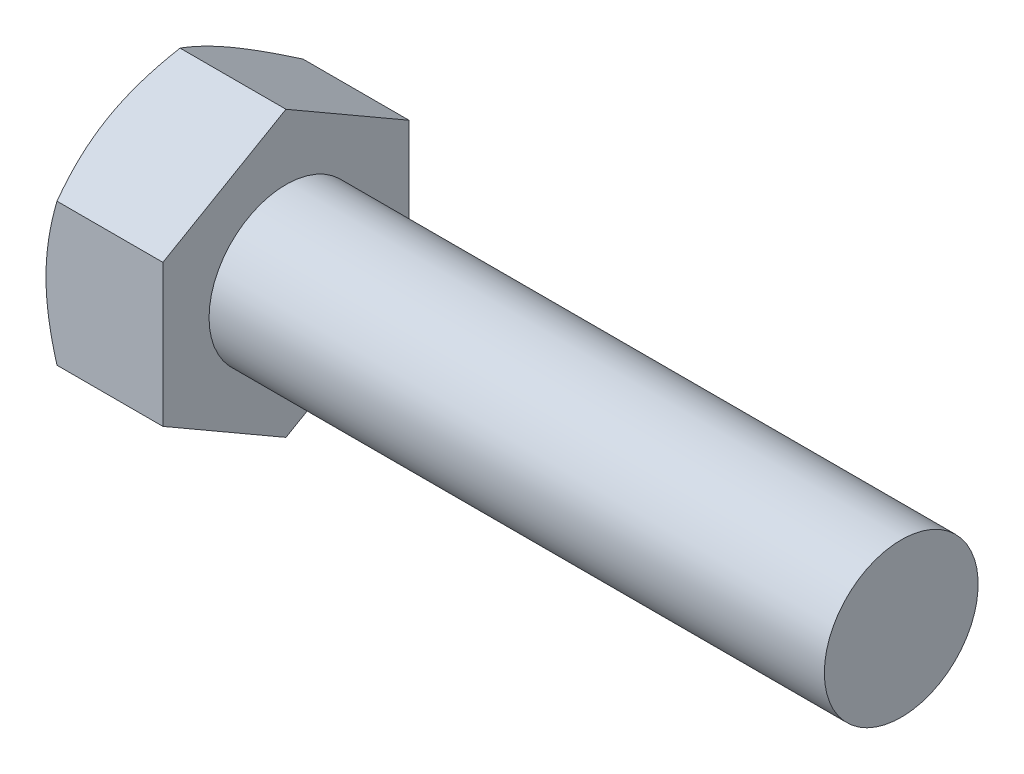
from build123d import *

# Parameters (mm, degrees)
SKETCH2_R     = 4.665127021
HEX_DIE_DEPTH = 3.8
SKETCH4_R     = 3.5
INDENT_DEPTH  = 0.475


with BuildPart() as part:
    # BodySke → Base-Revolve (revolve)
    with BuildSketch(Plane.XY, mode=Mode.PRIVATE) as base_revolve_sk:
        Polygon((3.8, 2.5), (3.8, 4.618937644), (0.357343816, 4.618937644), (0, 4), (0, 0), (23.8, 0), (23.8, 2.5), align=None)
    revolve(base_revolve_sk.sketch.rotate(Axis((-25.4, 0, 0), (1, 0, 0)), 90), axis=Axis((-25.4, 0, 0), (1, 0, 0)))

    # Sketch2 → Hex-Die (cut)
    with BuildSketch(Plane(origin=(0, 0, 0), x_dir=(0, 0, -1), z_dir=(1, 0, 0))):
        Circle(SKETCH2_R)
        Polygon((-4, 2.309401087), (0, 4.618802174), (4, 2.309401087), (4, -2.309401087), (0, -4.618802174), (-4, -2.309401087), align=None, mode=Mode.SUBTRACT)
    extrude(amount=HEX_DIE_DEPTH, mode=Mode.SUBTRACT)

    # Sketch4 → Indent (cut)
    with BuildSketch(Plane(origin=(0, 0, 0), x_dir=(0, 0, -1), z_dir=(1, 0, 0))):
        with Locations(Location((0, 0, 0), (0, 0, 180))):
            Circle(SKETCH4_R)
    extrude(amount=INDENT_DEPTH, mode=Mode.SUBTRACT)


solid = part.part
